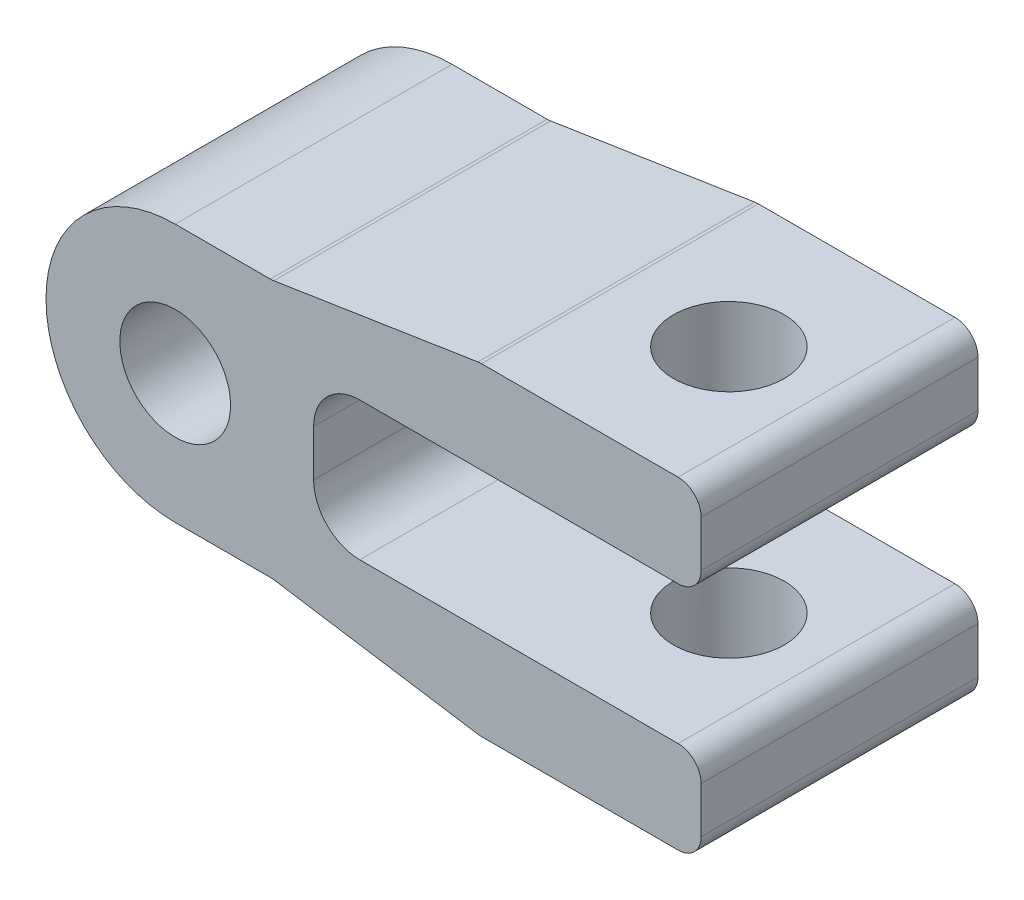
from build123d import *

# Parameters (mm, degrees)
ESQUISSE1_R             = 6
BASE_EXTRUSION_DEPTH    = 30
ESQUISSE2_R             = 6
ENL_V_MAT_EXTRU_1_DEPTH = 74.307571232


with BuildPart() as part:
    # Esquisse1 → Base-Extrusion (new body)
    with BuildSketch(Plane.XY):
        with BuildLine():
            Line((15, 2.5), (15, -2.5))
            ThreePointArc((15, -2.5), (16.464466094, -6.035533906), (20, -7.5))
            Line((20, -7.5), (54.5, -7.5))
            ThreePointArc((54.5, -7.5), (56.267766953, -8.232233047), (57, -10))
            Line((57, -10), (57, -15))
            ThreePointArc((57, -15), (56.267766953, -16.767766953), (54.5, -17.5))
            Line((54.5, -17.5), (33.193282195, -17.5))
            ThreePointArc((33.193282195, -17.5), (33.000575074, -17.492561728), (32.80901468, -17.470291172))
            Line((32.80901468, -17.470291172), (10.69098532, -14.029708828))
            ThreePointArc((10.69098532, -14.029708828), (10.499424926, -14.007438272), (10.306717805, -14))
            Line((10.306717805, -14), (0, -14))
            ThreePointArc((0, -14), (-14, 0), (0, 14))
            Line((0, 14), (10.306717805, 14))
            ThreePointArc((10.306717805, 14), (10.499424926, 14.007438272), (10.69098532, 14.029708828))
            Line((10.69098532, 14.029708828), (32.80901468, 17.470291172))
            ThreePointArc((32.80901468, 17.470291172), (33.000575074, 17.492561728), (33.193282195, 17.5))
            Line((33.193282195, 17.5), (54.5, 17.5))
            ThreePointArc((54.5, 17.5), (56.267766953, 16.767766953), (57, 15))
            Line((57, 15), (57, 10))
            ThreePointArc((57, 10), (56.267766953, 8.232233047), (54.5, 7.5))
            Line((54.5, 7.5), (20, 7.5))
            ThreePointArc((20, 7.5), (16.464466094, 6.035533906), (15, 2.5))
        make_face()
        Circle(ESQUISSE1_R, mode=Mode.SUBTRACT)
    extrude(amount=BASE_EXTRUSION_DEPTH)

    # Esquisse2 → Enl_v. mat.-Extru.1 (cut, through all)
    with BuildSketch(Plane.XZ.offset(17.5)):
        with Locations((45, 15)):
            Circle(ESQUISSE2_R)
    extrude(amount=-ENL_V_MAT_EXTRU_1_DEPTH, mode=Mode.SUBTRACT)


solid = part.part
